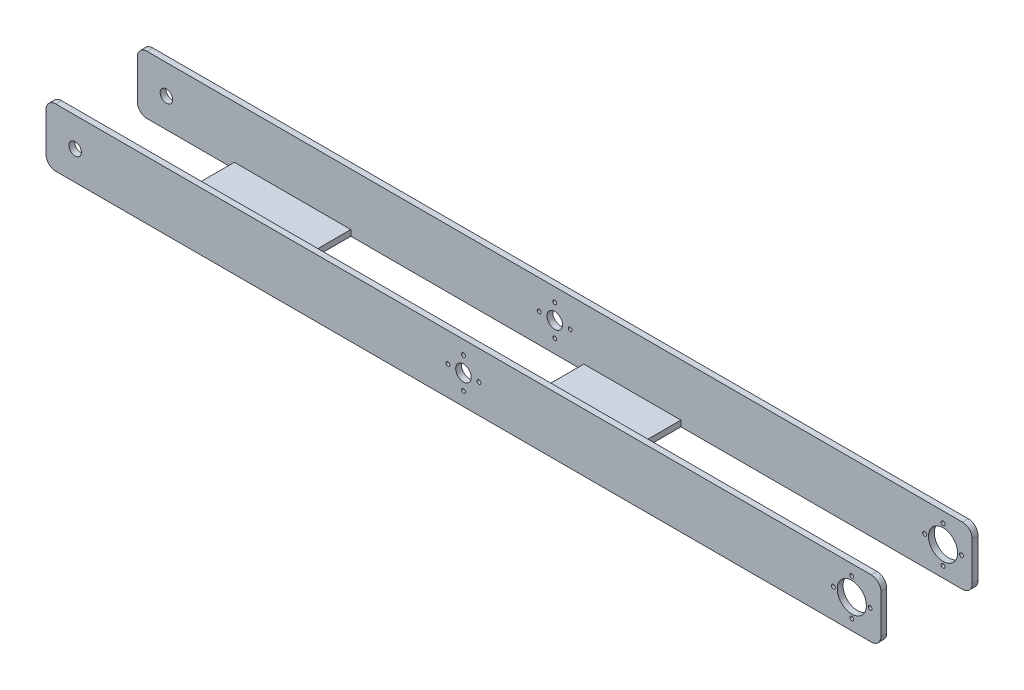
from build123d import *

# Parameters (mm, degrees)
SKETCH1_W           = 430
SKETCH1_H           = 30
BOSS_EXTRUDE1_DEPTH = 50
SHELL3_T            = -3
CUT_EXTRUDE3_REACH  = 224.383
SKETCH2_W           = 150
SKETCH2_H           = 44
SKETCH2_W_2         = 50
SKETCH2_W_3         = 120
SKETCH2_H_2         = 44.231987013
SKETCH3_R           = 4
SKETCH3_R_2         = 1
SKETCH3_R_3         = 3.2
SKETCH3_R_4         = 7.5
CUT_EXTRUDE2_DEPTH  = 222.246468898
FILLET1_R           = 5


with BuildPart() as part:
    # Sketch1 → Boss-Extrude1 (new body)
    with BuildSketch(Plane.XY):
        Rectangle(SKETCH1_W, SKETCH1_H)
    extrude(amount=BOSS_EXTRUDE1_DEPTH)

    # Shell3
    shell3_openings = [part.faces().sort_by_distance(p)[0] for p in [
        (-215, 0, 25),
        (0, 15, 25),
        (215, 0, 25),
    ]]
    offset(amount=SHELL3_T, openings=shell3_openings, kind=Kind.INTERSECTION)

    # Sketch2 → Cut-Extrude3 (cut, up to next)
    with BuildSketch(Plane(origin=(0, -12, 0), x_dir=(1, 0, 0), z_dir=(0, 1, 0)), mode=Mode.PRIVATE) as cut_extrude3_sk1:
        with Locations((140, -25)):
            Rectangle(SKETCH2_W, SKETCH2_H)
    cut_extrude3_tool1 = extrude(cut_extrude3_sk1.sketch, amount=-CUT_EXTRUDE3_REACH, mode=Mode.PRIVATE) & part.part
    # Sketch2 → Cut-Extrude3 (cut, up to next)
    with BuildSketch(Plane(origin=(0, -12, 0), x_dir=(1, 0, 0), z_dir=(0, 1, 0)), mode=Mode.PRIVATE) as cut_extrude3_sk2:
        with Locations((-190, -25)):
            Rectangle(SKETCH2_W_2, SKETCH2_H)
    cut_extrude3_tool2 = extrude(cut_extrude3_sk2.sketch, amount=-CUT_EXTRUDE3_REACH, mode=Mode.PRIVATE) & part.part
    # Sketch2 → Cut-Extrude3 (cut, up to next)
    with BuildSketch(Plane(origin=(0, -12, 0), x_dir=(1, 0, 0), z_dir=(0, 1, 0)), mode=Mode.PRIVATE) as cut_extrude3_sk3:
        with Locations((-45, -25.115993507)):
            Rectangle(SKETCH2_W_3, SKETCH2_H_2)
    cut_extrude3_tool3 = extrude(cut_extrude3_sk3.sketch, amount=-CUT_EXTRUDE3_REACH, mode=Mode.PRIVATE) & part.part
    add(cut_extrude3_tool1.solids().sort_by_distance((140, -12, 25))[0], mode=Mode.SUBTRACT)
    add(cut_extrude3_tool2.solids().sort_by_distance((-190, -12, 25))[0], mode=Mode.SUBTRACT)
    add(cut_extrude3_tool3.solids().sort_by_distance((-45, -12, 25.115994))[0], mode=Mode.SUBTRACT)

    # Sketch3 → Cut-Extrude2 (cut, through all)
    with BuildSketch(Plane(origin=(0, 0, 0), x_dir=(-1, 0, 0), z_dir=(0, 0, -1))):
        Circle(SKETCH3_R)
        with Locations((0, 8)):
            Circle(SKETCH3_R_2)
        with Locations((0, -8)):
            Circle(SKETCH3_R_2)
        with Locations((8, 0)):
            Circle(SKETCH3_R_2)
        with Locations((-8, 0)):
            Circle(SKETCH3_R_2)
        with Locations((200, 0)):
            Circle(SKETCH3_R_3)
        with Locations((-200, 0)):
            Circle(SKETCH3_R_4)
        with Locations((-200, 9.5)):
            Circle(SKETCH3_R_2)
        with Locations((-190.5, 0)):
            Circle(SKETCH3_R_2)
        with Locations((-200, -9.5)):
            Circle(SKETCH3_R_2)
        with Locations((-209.5, 0)):
            Circle(SKETCH3_R_2)
    extrude(amount=-CUT_EXTRUDE2_DEPTH, mode=Mode.SUBTRACT)

    # Fillet1
    fillet1_edges = [part.edges().sort_by_distance(p)[0] for p in [
        (-215, 15, 1.5),
        (215, 15, 1.5),
        (215, -15, 1.5),
        (-215, -15, 1.5),
        (215, -15, 48.5),
        (-215, -15, 48.5),
        (-215, 15, 48.5),
        (215, 15, 48.5),
    ]]
    fillet(fillet1_edges, radius=FILLET1_R)


solid = part.part
